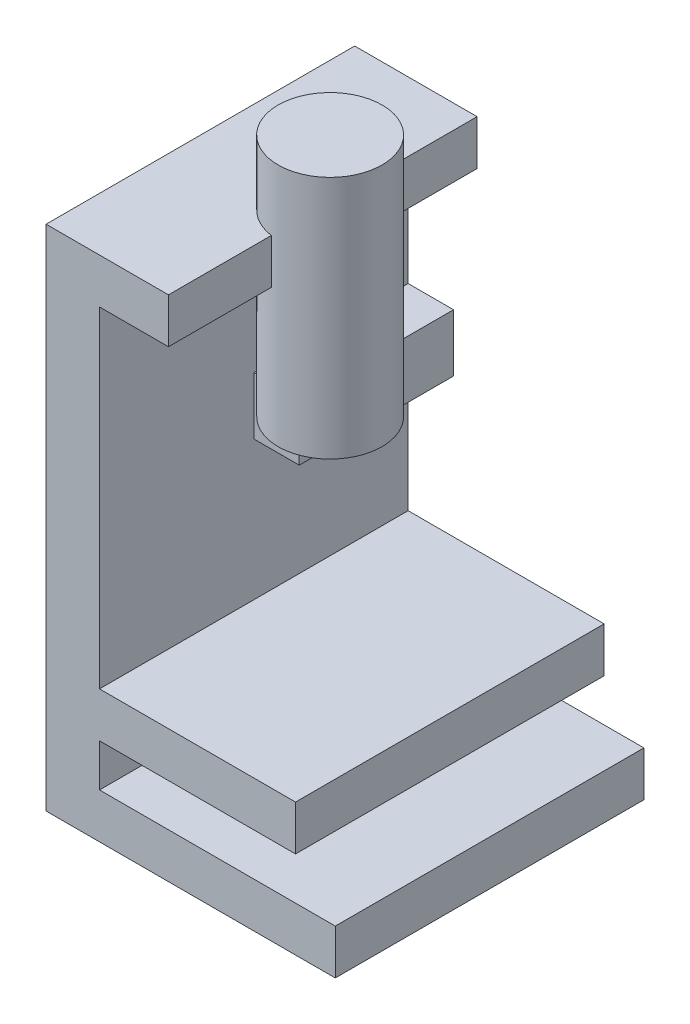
from build123d import *

# Parameters (mm, degrees)
EXTRUDE1_DEPTH      = 47.5
CUT_EXTRUDE1_REACH  = 190.764
SKETCH3_W           = 13.972525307
SKETCH3_H           = 47.5
BOSS_EXTRUDE1_START = 10
SKETCH2_R           = 15.997741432
BOSS_EXTRUDE1_DEPTH = 75.097987


with BuildPart() as part:
    # Sketch1 → Extrude1 (new, symmetric)
    with BuildSketch(Plane(origin=(8.56426308, -28.387824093, 0), x_dir=(0, 1, 0), z_dir=(0, 0, 1))):
        Polygon((-58.163386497, -54.421285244), (98.277260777, -54.421285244), (98.277260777, -92.090296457), (84.43636424, -92.090296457), (84.43636424, -70.863158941), (43.179274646, -70.863158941), (43.179274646, -84.835684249), (25.496253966, -84.835684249), (25.496253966, -70.863158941), (-17.378927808, -70.863158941), (-17.378927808, -131.201948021), (-31.219824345, -131.201948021), (-31.219824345, -70.863158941), (-44.32248996, -70.863158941), (-44.32248996, -143.440294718), (-58.163386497, -143.440294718), align=None)
    extrude(amount=EXTRUDE1_DEPTH, both=True)

    # Sketch3 → Cut-Extrude1 (cut, up to next)
    with BuildSketch(Plane(origin=(0, 14.791450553, 0), x_dir=(-1, 0, 0), z_dir=(0, 1, 0)), mode=Mode.PRIVATE) as cut_extrude1_sk1:
        with Locations((-86.413684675, 23.75)):
            Rectangle(SKETCH3_W, SKETCH3_H)
    cut_extrude1_tool1 = extrude(cut_extrude1_sk1.sketch, amount=-CUT_EXTRUDE1_REACH, mode=Mode.PRIVATE) & part.part
    add(cut_extrude1_tool1.solids().sort_by_distance((86.413685, 14.791451, 23.75))[0], mode=Mode.SUBTRACT)


with BuildPart() as body_2:
    # Sketch2 → Boss-Extrude1 (new body)
    with BuildSketch(Plane(origin=(0, 79.889436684, 0), x_dir=(-1, 0, 0), z_dir=(0, 1, 0)).offset(BOSS_EXTRUDE1_START)):
        with Locations((-102.914286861, 0)):
            Circle(SKETCH2_R)
    extrude(amount=-BOSS_EXTRUDE1_DEPTH)


solid = Compound([part.part, body_2.part])
